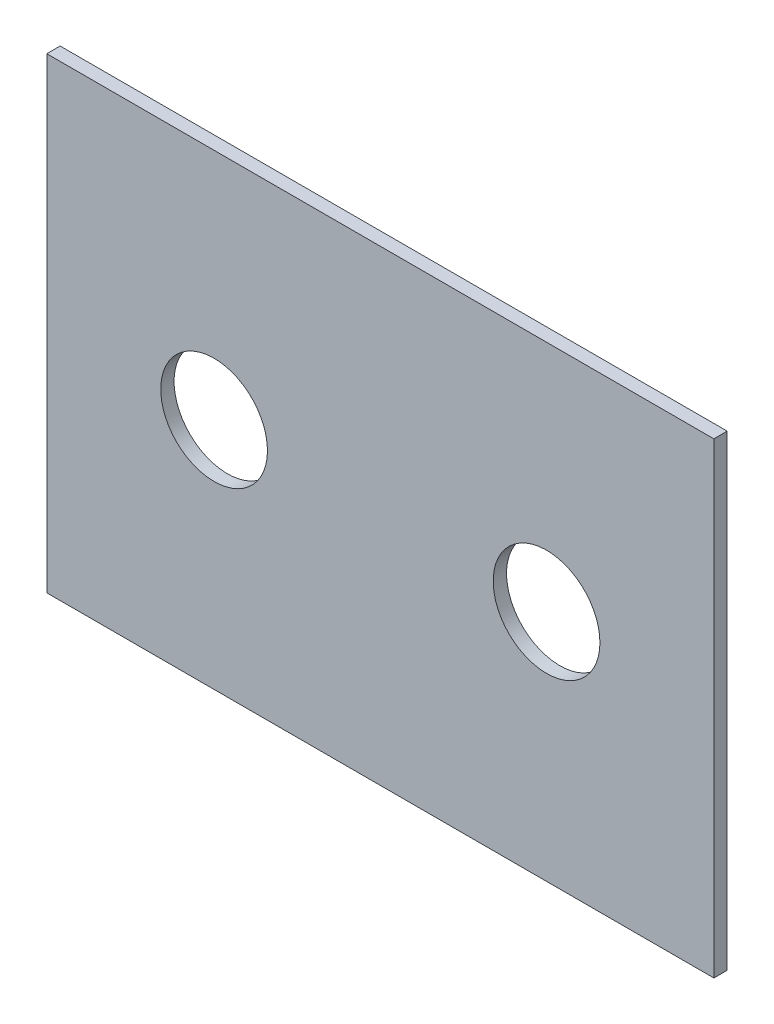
ISO-10303-21;
HEADER;
FILE_DESCRIPTION(('STEP AP214'),'2;1');
FILE_NAME('part.step','',(''),(''),'','','');
FILE_SCHEMA(('AUTOMOTIVE_DESIGN { 1 0 10303 214 1 1 1 1 }'));
ENDSEC;
DATA;
#1=APPLICATION_CONTEXT('core data for automotive mechanical design processes');
#2=APPLICATION_PROTOCOL_DEFINITION('international standard','automotive_design',2000,#1);
#3=PRODUCT_CONTEXT('',#1,'mechanical');
#4=PRODUCT('Part','Part','',(#3));
#5=PRODUCT_RELATED_PRODUCT_CATEGORY('part','',(#4));
#6=PRODUCT_DEFINITION_FORMATION('','',#4);
#7=PRODUCT_DEFINITION_CONTEXT('part definition',#1,'design');
#8=PRODUCT_DEFINITION('design','',#6,#7);
#9=PRODUCT_DEFINITION_SHAPE('','',#8);
#10=(LENGTH_UNIT() NAMED_UNIT(*) SI_UNIT(.MILLI.,.METRE.));
#11=(NAMED_UNIT(*) PLANE_ANGLE_UNIT() SI_UNIT($,.RADIAN.));
#12=(NAMED_UNIT(*) SI_UNIT($,.STERADIAN.) SOLID_ANGLE_UNIT());
#13=UNCERTAINTY_MEASURE_WITH_UNIT(LENGTH_MEASURE(1.E-05),#10,'distance_accuracy_value','');
#14=(GEOMETRIC_REPRESENTATION_CONTEXT(3) GLOBAL_UNCERTAINTY_ASSIGNED_CONTEXT((#13)) GLOBAL_UNIT_ASSIGNED_CONTEXT((#10,
#11,#12)) REPRESENTATION_CONTEXT('',''));
#15=CARTESIAN_POINT('',(0.,0.,0.));
#16=DIRECTION('',(0.,0.,1.));
#17=DIRECTION('',(1.,0.,0.));
#18=AXIS2_PLACEMENT_3D('',#15,#16,#17);
#19=CARTESIAN_POINT('',(-2.08166817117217E-13,0.,0.999999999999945));
#20=DIRECTION('',(0.,0.,-0.999999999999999));
#21=DIRECTION('',(-1.,0.,0.));
#22=AXIS2_PLACEMENT_3D('',#19,#20,#21);
#23=PLANE('',#22);
#24=DIRECTION('',(0.,0.999999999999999,0.));
#25=VECTOR('',#24,1.);
#26=CARTESIAN_POINT('',(24.9999999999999,-17.4999999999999,0.999999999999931));
#27=LINE('',#26,#25);
#28=CARTESIAN_POINT('',(24.9999999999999,-17.4999999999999,0.999999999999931));
#29=VERTEX_POINT('',#28);
#30=CARTESIAN_POINT('',(24.9999999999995,17.5,1.));
#31=VERTEX_POINT('',#30);
#32=EDGE_CURVE('E91',#29,#31,#27,.T.);
#33=ORIENTED_EDGE('',*,*,#32,.T.);
#34=DIRECTION('',(-0.999999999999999,0.,0.));
#35=VECTOR('',#34,1.);
#36=CARTESIAN_POINT('',(-25.0000000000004,17.5,0.999999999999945));
#37=LINE('',#36,#35);
#38=CARTESIAN_POINT('',(-25.0000000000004,17.5,0.999999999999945));
#39=VERTEX_POINT('',#38);
#40=EDGE_CURVE('E86',#31,#39,#37,.T.);
#41=ORIENTED_EDGE('',*,*,#40,.T.);
#42=DIRECTION('',(0.,-0.999999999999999,0.));
#43=VECTOR('',#42,1.);
#44=CARTESIAN_POINT('',(-25.0000000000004,-17.5,0.999999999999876));
#45=LINE('',#44,#43);
#46=CARTESIAN_POINT('',(-25.0000000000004,-17.5,0.999999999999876));
#47=VERTEX_POINT('',#46);
#48=EDGE_CURVE('E89',#39,#47,#45,.T.);
#49=ORIENTED_EDGE('',*,*,#48,.T.);
#50=DIRECTION('',(0.999999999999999,0.,0.));
#51=VECTOR('',#50,1.);
#52=CARTESIAN_POINT('',(-25.0000000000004,-17.5,0.999999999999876));
#53=LINE('',#52,#51);
#54=EDGE_CURVE('E56',#47,#29,#53,.T.);
#55=ORIENTED_EDGE('',*,*,#54,.T.);
#56=EDGE_LOOP('',(#33,#41,#49,#55));
#57=FACE_BOUND('',#56,.T.);
#58=CARTESIAN_POINT('',(12.4599357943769,0.,1.));
#59=DIRECTION('',(0.,0.,0.999999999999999));
#60=DIRECTION('',(1.,0.,0.));
#61=AXIS2_PLACEMENT_3D('',#58,#59,#60);
#62=CIRCLE('',#61,4.);
#63=CARTESIAN_POINT('',(16.4599357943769,0.,1.));
#64=VERTEX_POINT('',#63);
#65=EDGE_CURVE('E119',#64,#64,#62,.T.);
#66=ORIENTED_EDGE('',*,*,#65,.F.);
#67=EDGE_LOOP('',(#66));
#68=FACE_BOUND('',#67,.T.);
#69=CARTESIAN_POINT('',(-12.4599357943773,0.,0.999999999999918));
#70=DIRECTION('',(0.,0.,0.999999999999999));
#71=DIRECTION('',(1.,0.,0.));
#72=AXIS2_PLACEMENT_3D('',#69,#70,#71);
#73=CIRCLE('',#72,4.);
#74=CARTESIAN_POINT('',(-8.45993579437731,0.,0.999999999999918));
#75=VERTEX_POINT('',#74);
#76=EDGE_CURVE('E125',#75,#75,#73,.T.);
#77=ORIENTED_EDGE('',*,*,#76,.F.);
#78=EDGE_LOOP('',(#77));
#79=FACE_BOUND('',#78,.T.);
#80=ADVANCED_FACE('F39',(#57,#68,#79),#23,.F.);
#81=CARTESIAN_POINT('',(24.9999999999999,-17.4999999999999,0.999999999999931));
#82=DIRECTION('',(-1.,0.,0.));
#83=DIRECTION('',(0.,0.,0.999999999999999));
#84=AXIS2_PLACEMENT_3D('',#81,#82,#83);
#85=PLANE('',#84);
#86=DIRECTION('',(0.,0.999999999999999,0.));
#87=VECTOR('',#86,1.);
#88=CARTESIAN_POINT('',(24.9999999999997,-17.5,0.));
#89=LINE('',#88,#87);
#90=CARTESIAN_POINT('',(24.9999999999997,-17.5,0.));
#91=VERTEX_POINT('',#90);
#92=CARTESIAN_POINT('',(24.9999999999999,17.5,0.));
#93=VERTEX_POINT('',#92);
#94=EDGE_CURVE('E103',#91,#93,#89,.T.);
#95=ORIENTED_EDGE('',*,*,#94,.T.);
#96=DIRECTION('',(0.,0.,-0.999999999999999));
#97=VECTOR('',#96,1.);
#98=CARTESIAN_POINT('',(24.9999999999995,17.5,1.));
#99=LINE('',#98,#97);
#100=EDGE_CURVE('E11',#31,#93,#99,.T.);
#101=ORIENTED_EDGE('',*,*,#100,.F.);
#102=ORIENTED_EDGE('',*,*,#32,.F.);
#103=DIRECTION('',(0.,0.,-0.999999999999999));
#104=VECTOR('',#103,1.);
#105=CARTESIAN_POINT('',(24.9999999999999,-17.4999999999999,0.999999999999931));
#106=LINE('',#105,#104);
#107=EDGE_CURVE('E99',#29,#91,#106,.T.);
#108=ORIENTED_EDGE('',*,*,#107,.T.);
#109=EDGE_LOOP('',(#95,#101,#102,#108));
#110=FACE_BOUND('',#109,.T.);
#111=ADVANCED_FACE('F41',(#110),#85,.F.);
#112=CARTESIAN_POINT('',(-25.0000000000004,17.5,0.999999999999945));
#113=DIRECTION('',(0.,-0.999999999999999,0.));
#114=DIRECTION('',(0.,0.,-0.999999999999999));
#115=AXIS2_PLACEMENT_3D('',#112,#113,#114);
#116=PLANE('',#115);
#117=DIRECTION('',(-0.999999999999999,0.,0.));
#118=VECTOR('',#117,1.);
#119=CARTESIAN_POINT('',(-25.0000000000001,17.5,0.));
#120=LINE('',#119,#118);
#121=CARTESIAN_POINT('',(-25.0000000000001,17.5,0.));
#122=VERTEX_POINT('',#121);
#123=EDGE_CURVE('E95',#93,#122,#120,.T.);
#124=ORIENTED_EDGE('',*,*,#123,.T.);
#125=DIRECTION('',(0.,0.,-0.999999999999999));
#126=VECTOR('',#125,1.);
#127=CARTESIAN_POINT('',(-25.0000000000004,17.5,0.999999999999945));
#128=LINE('',#127,#126);
#129=EDGE_CURVE('E48',#39,#122,#128,.T.);
#130=ORIENTED_EDGE('',*,*,#129,.F.);
#131=ORIENTED_EDGE('',*,*,#40,.F.);
#132=ORIENTED_EDGE('',*,*,#100,.T.);
#133=EDGE_LOOP('',(#124,#130,#131,#132));
#134=FACE_BOUND('',#133,.T.);
#135=ADVANCED_FACE('F94',(#134),#116,.F.);
#136=CARTESIAN_POINT('',(-25.0000000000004,-17.5,0.999999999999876));
#137=DIRECTION('',(1.,0.,0.));
#138=DIRECTION('',(0.,0.,-0.999999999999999));
#139=AXIS2_PLACEMENT_3D('',#136,#137,#138);
#140=PLANE('',#139);
#141=DIRECTION('',(0.,-0.999999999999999,0.));
#142=VECTOR('',#141,1.);
#143=CARTESIAN_POINT('',(-25.0000000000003,-17.5,-1.11022302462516E-13));
#144=LINE('',#143,#142);
#145=CARTESIAN_POINT('',(-25.0000000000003,-17.5,-1.11022302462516E-13));
#146=VERTEX_POINT('',#145);
#147=EDGE_CURVE('E73',#122,#146,#144,.T.);
#148=ORIENTED_EDGE('',*,*,#147,.T.);
#149=DIRECTION('',(0.,0.,-0.999999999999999));
#150=VECTOR('',#149,1.);
#151=CARTESIAN_POINT('',(-25.0000000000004,-17.5,0.999999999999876));
#152=LINE('',#151,#150);
#153=EDGE_CURVE('E96',#47,#146,#152,.T.);
#154=ORIENTED_EDGE('',*,*,#153,.F.);
#155=ORIENTED_EDGE('',*,*,#48,.F.);
#156=ORIENTED_EDGE('',*,*,#129,.T.);
#157=EDGE_LOOP('',(#148,#154,#155,#156));
#158=FACE_BOUND('',#157,.T.);
#159=ADVANCED_FACE('F97',(#158),#140,.F.);
#160=CARTESIAN_POINT('',(-25.0000000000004,-17.5,0.999999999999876));
#161=DIRECTION('',(0.,0.999999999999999,0.));
#162=DIRECTION('',(0.,0.,0.999999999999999));
#163=AXIS2_PLACEMENT_3D('',#160,#161,#162);
#164=PLANE('',#163);
#165=DIRECTION('',(0.999999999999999,0.,0.));
#166=VECTOR('',#165,1.);
#167=CARTESIAN_POINT('',(-25.0000000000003,-17.5,-1.11022302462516E-13));
#168=LINE('',#167,#166);
#169=EDGE_CURVE('E79',#146,#91,#168,.T.);
#170=ORIENTED_EDGE('',*,*,#169,.T.);
#171=ORIENTED_EDGE('',*,*,#107,.F.);
#172=ORIENTED_EDGE('',*,*,#54,.F.);
#173=ORIENTED_EDGE('',*,*,#153,.T.);
#174=EDGE_LOOP('',(#170,#171,#172,#173));
#175=FACE_BOUND('',#174,.T.);
#176=ADVANCED_FACE('F111',(#175),#164,.F.);
#177=CARTESIAN_POINT('',(0.,0.,0.));
#178=DIRECTION('',(0.,0.,-0.999999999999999));
#179=DIRECTION('',(-1.,0.,0.));
#180=AXIS2_PLACEMENT_3D('',#177,#178,#179);
#181=PLANE('',#180);
#182=CARTESIAN_POINT('',(-12.4599357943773,0.,0.));
#183=DIRECTION('',(0.,0.,-0.999999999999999));
#184=DIRECTION('',(-1.,0.,0.));
#185=AXIS2_PLACEMENT_3D('',#182,#183,#184);
#186=CIRCLE('',#185,4.);
#187=CARTESIAN_POINT('',(-8.45993579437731,0.,0.));
#188=VERTEX_POINT('',#187);
#189=EDGE_CURVE('E122',#188,#188,#186,.T.);
#190=ORIENTED_EDGE('',*,*,#189,.F.);
#191=EDGE_LOOP('',(#190));
#192=FACE_BOUND('',#191,.T.);
#193=CARTESIAN_POINT('',(12.4599357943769,0.,0.));
#194=DIRECTION('',(0.,0.,-0.999999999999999));
#195=DIRECTION('',(-1.,0.,0.));
#196=AXIS2_PLACEMENT_3D('',#193,#194,#195);
#197=CIRCLE('',#196,4.);
#198=CARTESIAN_POINT('',(16.4599357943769,0.,0.));
#199=VERTEX_POINT('',#198);
#200=EDGE_CURVE('E106',#199,#199,#197,.T.);
#201=ORIENTED_EDGE('',*,*,#200,.F.);
#202=EDGE_LOOP('',(#201));
#203=FACE_BOUND('',#202,.T.);
#204=ORIENTED_EDGE('',*,*,#94,.F.);
#205=ORIENTED_EDGE('',*,*,#169,.F.);
#206=ORIENTED_EDGE('',*,*,#147,.F.);
#207=ORIENTED_EDGE('',*,*,#123,.F.);
#208=EDGE_LOOP('',(#204,#205,#206,#207));
#209=FACE_BOUND('',#208,.T.);
#210=ADVANCED_FACE('F114',(#192,#203,#209),#181,.T.);
#211=CARTESIAN_POINT('',(12.4599357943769,0.,1.));
#212=DIRECTION('',(0.,0.,0.999999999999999));
#213=DIRECTION('',(1.,0.,0.));
#214=AXIS2_PLACEMENT_3D('',#211,#212,#213);
#215=CYLINDRICAL_SURFACE('',#214,4.);
#216=CARTESIAN_POINT('',(16.4599357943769,0.,1.));
#217=CARTESIAN_POINT('',(16.4599357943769,0.,0.989583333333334));
#218=CARTESIAN_POINT('',(16.4599357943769,0.,0.979166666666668));
#219=CARTESIAN_POINT('',(16.4599357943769,0.,0.958333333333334));
#220=CARTESIAN_POINT('',(16.4599357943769,0.,0.947916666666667));
#221=CARTESIAN_POINT('',(16.4599357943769,0.,0.927083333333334));
#222=CARTESIAN_POINT('',(16.4599357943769,0.,0.916666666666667));
#223=CARTESIAN_POINT('',(16.4599357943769,0.,0.895833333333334));
#224=CARTESIAN_POINT('',(16.4599357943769,0.,0.885416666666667));
#225=CARTESIAN_POINT('',(16.4599357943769,0.,0.864583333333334));
#226=CARTESIAN_POINT('',(16.4599357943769,0.,0.854166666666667));
#227=CARTESIAN_POINT('',(16.4599357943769,0.,0.833333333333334));
#228=CARTESIAN_POINT('',(16.4599357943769,0.,0.822916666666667));
#229=CARTESIAN_POINT('',(16.4599357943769,0.,0.802083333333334));
#230=CARTESIAN_POINT('',(16.4599357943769,0.,0.791666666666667));
#231=CARTESIAN_POINT('',(16.4599357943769,0.,0.770833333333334));
#232=CARTESIAN_POINT('',(16.4599357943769,0.,0.760416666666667));
#233=CARTESIAN_POINT('',(16.4599357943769,0.,0.739583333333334));
#234=CARTESIAN_POINT('',(16.4599357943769,0.,0.729166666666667));
#235=CARTESIAN_POINT('',(16.4599357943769,0.,0.708333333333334));
#236=CARTESIAN_POINT('',(16.4599357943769,0.,0.697916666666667));
#237=CARTESIAN_POINT('',(16.4599357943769,0.,0.677083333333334));
#238=CARTESIAN_POINT('',(16.4599357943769,0.,0.666666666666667));
#239=CARTESIAN_POINT('',(16.4599357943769,0.,0.645833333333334));
#240=CARTESIAN_POINT('',(16.4599357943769,0.,0.635416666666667));
#241=CARTESIAN_POINT('',(16.4599357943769,0.,0.614583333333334));
#242=CARTESIAN_POINT('',(16.4599357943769,0.,0.604166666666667));
#243=CARTESIAN_POINT('',(16.4599357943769,0.,0.583333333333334));
#244=CARTESIAN_POINT('',(16.4599357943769,0.,0.572916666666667));
#245=CARTESIAN_POINT('',(16.4599357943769,0.,0.552083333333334));
#246=CARTESIAN_POINT('',(16.4599357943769,0.,0.541666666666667));
#247=CARTESIAN_POINT('',(16.4599357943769,0.,0.520833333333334));
#248=CARTESIAN_POINT('',(16.4599357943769,0.,0.510416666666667));
#249=CARTESIAN_POINT('',(16.4599357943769,0.,0.489583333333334));
#250=CARTESIAN_POINT('',(16.4599357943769,0.,0.479166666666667));
#251=CARTESIAN_POINT('',(16.4599357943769,0.,0.458333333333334));
#252=CARTESIAN_POINT('',(16.4599357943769,0.,0.447916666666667));
#253=CARTESIAN_POINT('',(16.4599357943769,0.,0.427083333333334));
#254=CARTESIAN_POINT('',(16.4599357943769,0.,0.416666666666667));
#255=CARTESIAN_POINT('',(16.4599357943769,0.,0.395833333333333));
#256=CARTESIAN_POINT('',(16.4599357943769,0.,0.385416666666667));
#257=CARTESIAN_POINT('',(16.4599357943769,0.,0.364583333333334));
#258=CARTESIAN_POINT('',(16.4599357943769,0.,0.354166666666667));
#259=CARTESIAN_POINT('',(16.4599357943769,0.,0.333333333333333));
#260=CARTESIAN_POINT('',(16.4599357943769,0.,0.322916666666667));
#261=CARTESIAN_POINT('',(16.4599357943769,0.,0.302083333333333));
#262=CARTESIAN_POINT('',(16.4599357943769,0.,0.291666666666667));
#263=CARTESIAN_POINT('',(16.4599357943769,0.,0.270833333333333));
#264=CARTESIAN_POINT('',(16.4599357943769,0.,0.260416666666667));
#265=CARTESIAN_POINT('',(16.4599357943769,0.,0.239583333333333));
#266=CARTESIAN_POINT('',(16.4599357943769,0.,0.229166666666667));
#267=CARTESIAN_POINT('',(16.4599357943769,0.,0.208333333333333));
#268=CARTESIAN_POINT('',(16.4599357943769,0.,0.197916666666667));
#269=CARTESIAN_POINT('',(16.4599357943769,0.,0.177083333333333));
#270=CARTESIAN_POINT('',(16.4599357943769,0.,0.166666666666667));
#271=CARTESIAN_POINT('',(16.4599357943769,0.,0.145833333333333));
#272=CARTESIAN_POINT('',(16.4599357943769,0.,0.135416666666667));
#273=CARTESIAN_POINT('',(16.4599357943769,0.,0.114583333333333));
#274=CARTESIAN_POINT('',(16.4599357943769,0.,0.104166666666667));
#275=CARTESIAN_POINT('',(16.4599357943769,0.,0.0833333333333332));
#276=CARTESIAN_POINT('',(16.4599357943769,0.,0.0729166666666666));
#277=CARTESIAN_POINT('',(16.4599357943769,0.,0.0520833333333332));
#278=CARTESIAN_POINT('',(16.4599357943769,0.,0.0416666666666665));
#279=CARTESIAN_POINT('',(16.4599357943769,0.,0.0208333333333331));
#280=CARTESIAN_POINT('',(16.4599357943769,0.,0.0104166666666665));
#281=CARTESIAN_POINT('',(16.4599357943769,0.,0.));
#282=B_SPLINE_CURVE_WITH_KNOTS('',3,(#216,#217,#218,#219,#220,#221,#222,#223,#224,#225,#226,
#227,#228,#229,#230,#231,#232,#233,#234,#235,#236,#237,#238,#239,#240,#241,#242,#243,#244,#245,
#246,#247,#248,#249,#250,#251,#252,#253,#254,#255,#256,#257,#258,#259,#260,#261,#262,#263,#264,
#265,#266,#267,#268,#269,#270,#271,#272,#273,#274,#275,#276,#277,#278,#279,#280,#281),
.UNSPECIFIED.,.F.,.F.,(4,2,2,2,2,2,2,2,2,2,2,2,2,2,2,2,2,2,2,2,2,2,2,2,2,2,2,2,2,2,2,2,4),(0.,
0.0312499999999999,0.0624999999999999,0.09375,0.125,0.15625,0.1875,0.21875,0.25,0.28125,0.3125,
0.34375,0.375,0.40625,0.4375,0.46875,0.5,0.53125,0.5625,0.593750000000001,0.625,
0.656250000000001,0.687500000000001,0.718750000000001,0.750000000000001,0.781250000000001,
0.812500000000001,0.843750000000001,0.875000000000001,0.906250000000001,0.937500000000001,
0.968750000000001,1.),.UNSPECIFIED.);
#283=EDGE_CURVE('BSEAM139',#64,#199,#282,.T.);
#284=ORIENTED_EDGE('',*,*,#65,.T.);
#285=ORIENTED_EDGE('',*,*,#200,.T.);
#286=ORIENTED_EDGE('',*,*,#283,.T.);
#287=ORIENTED_EDGE('',*,*,#283,.F.);
#288=EDGE_LOOP('',(#284,#286,#285,#287));
#289=FACE_BOUND('',#288,.T.);
#290=ADVANCED_FACE('F139',(#289),#215,.F.);
#291=CARTESIAN_POINT('',(-12.4599357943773,0.,0.999999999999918));
#292=DIRECTION('',(0.,0.,0.999999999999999));
#293=DIRECTION('',(1.,0.,0.));
#294=AXIS2_PLACEMENT_3D('',#291,#292,#293);
#295=CYLINDRICAL_SURFACE('',#294,4.);
#296=CARTESIAN_POINT('',(-8.45993579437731,0.,0.999999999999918));
#297=CARTESIAN_POINT('',(-8.45993579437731,0.,0.989583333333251));
#298=CARTESIAN_POINT('',(-8.45993579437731,0.,0.979166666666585));
#299=CARTESIAN_POINT('',(-8.45993579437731,0.,0.958333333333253));
#300=CARTESIAN_POINT('',(-8.45993579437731,0.,0.947916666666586));
#301=CARTESIAN_POINT('',(-8.45993579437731,0.,0.927083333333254));
#302=CARTESIAN_POINT('',(-8.45993579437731,0.,0.916666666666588));
#303=CARTESIAN_POINT('',(-8.45993579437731,0.,0.895833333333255));
#304=CARTESIAN_POINT('',(-8.45993579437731,0.,0.885416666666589));
#305=CARTESIAN_POINT('',(-8.45993579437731,0.,0.864583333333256));
#306=CARTESIAN_POINT('',(-8.45993579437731,0.,0.85416666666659));
#307=CARTESIAN_POINT('',(-8.45993579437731,0.,0.833333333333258));
#308=CARTESIAN_POINT('',(-8.45993579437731,0.,0.822916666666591));
#309=CARTESIAN_POINT('',(-8.45993579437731,0.,0.802083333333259));
#310=CARTESIAN_POINT('',(-8.45993579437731,0.,0.791666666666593));
#311=CARTESIAN_POINT('',(-8.45993579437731,0.,0.77083333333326));
#312=CARTESIAN_POINT('',(-8.45993579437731,0.,0.760416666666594));
#313=CARTESIAN_POINT('',(-8.45993579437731,0.,0.739583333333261));
#314=CARTESIAN_POINT('',(-8.45993579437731,0.,0.729166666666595));
#315=CARTESIAN_POINT('',(-8.45993579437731,0.,0.708333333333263));
#316=CARTESIAN_POINT('',(-8.45993579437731,0.,0.697916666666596));
#317=CARTESIAN_POINT('',(-8.45993579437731,0.,0.677083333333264));
#318=CARTESIAN_POINT('',(-8.45993579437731,0.,0.666666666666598));
#319=CARTESIAN_POINT('',(-8.45993579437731,0.,0.645833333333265));
#320=CARTESIAN_POINT('',(-8.45993579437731,0.,0.635416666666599));
#321=CARTESIAN_POINT('',(-8.45993579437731,0.,0.614583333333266));
#322=CARTESIAN_POINT('',(-8.45993579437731,0.,0.6041666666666));
#323=CARTESIAN_POINT('',(-8.45993579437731,0.,0.583333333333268));
#324=CARTESIAN_POINT('',(-8.45993579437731,0.,0.572916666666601));
#325=CARTESIAN_POINT('',(-8.45993579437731,0.,0.552083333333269));
#326=CARTESIAN_POINT('',(-8.45993579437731,0.,0.541666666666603));
#327=CARTESIAN_POINT('',(-8.45993579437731,0.,0.52083333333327));
#328=CARTESIAN_POINT('',(-8.45993579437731,0.,0.510416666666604));
#329=CARTESIAN_POINT('',(-8.45993579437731,0.,0.489583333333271));
#330=CARTESIAN_POINT('',(-8.45993579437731,0.,0.479166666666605));
#331=CARTESIAN_POINT('',(-8.45993579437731,0.,0.458333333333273));
#332=CARTESIAN_POINT('',(-8.45993579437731,0.,0.447916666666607));
#333=CARTESIAN_POINT('',(-8.45993579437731,0.,0.427083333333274));
#334=CARTESIAN_POINT('',(-8.45993579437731,0.,0.416666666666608));
#335=CARTESIAN_POINT('',(-8.45993579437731,0.,0.395833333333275));
#336=CARTESIAN_POINT('',(-8.45993579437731,0.,0.385416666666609));
#337=CARTESIAN_POINT('',(-8.45993579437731,0.,0.364583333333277));
#338=CARTESIAN_POINT('',(-8.45993579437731,0.,0.35416666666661));
#339=CARTESIAN_POINT('',(-8.45993579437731,0.,0.333333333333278));
#340=CARTESIAN_POINT('',(-8.45993579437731,0.,0.322916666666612));
#341=CARTESIAN_POINT('',(-8.45993579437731,0.,0.302083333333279));
#342=CARTESIAN_POINT('',(-8.45993579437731,0.,0.291666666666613));
#343=CARTESIAN_POINT('',(-8.45993579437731,0.,0.27083333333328));
#344=CARTESIAN_POINT('',(-8.45993579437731,0.,0.260416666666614));
#345=CARTESIAN_POINT('',(-8.45993579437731,0.,0.239583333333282));
#346=CARTESIAN_POINT('',(-8.45993579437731,0.,0.229166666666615));
#347=CARTESIAN_POINT('',(-8.45993579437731,0.,0.208333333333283));
#348=CARTESIAN_POINT('',(-8.45993579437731,0.,0.197916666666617));
#349=CARTESIAN_POINT('',(-8.45993579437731,0.,0.177083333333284));
#350=CARTESIAN_POINT('',(-8.45993579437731,0.,0.166666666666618));
#351=CARTESIAN_POINT('',(-8.45993579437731,0.,0.145833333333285));
#352=CARTESIAN_POINT('',(-8.45993579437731,0.,0.135416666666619));
#353=CARTESIAN_POINT('',(-8.45993579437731,0.,0.114583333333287));
#354=CARTESIAN_POINT('',(-8.45993579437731,0.,0.10416666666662));
#355=CARTESIAN_POINT('',(-8.45993579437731,0.,0.0833333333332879));
#356=CARTESIAN_POINT('',(-8.45993579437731,0.,0.0729166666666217));
#357=CARTESIAN_POINT('',(-8.45993579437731,0.,0.0520833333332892));
#358=CARTESIAN_POINT('',(-8.45993579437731,0.,0.0416666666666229));
#359=CARTESIAN_POINT('',(-8.45993579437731,0.,0.0208333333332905));
#360=CARTESIAN_POINT('',(-8.45993579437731,0.,0.0104166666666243));
#361=CARTESIAN_POINT('',(-8.45993579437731,0.,0.));
#362=B_SPLINE_CURVE_WITH_KNOTS('',3,(#296,#297,#298,#299,#300,#301,#302,#303,#304,#305,#306,
#307,#308,#309,#310,#311,#312,#313,#314,#315,#316,#317,#318,#319,#320,#321,#322,#323,#324,#325,
#326,#327,#328,#329,#330,#331,#332,#333,#334,#335,#336,#337,#338,#339,#340,#341,#342,#343,#344,
#345,#346,#347,#348,#349,#350,#351,#352,#353,#354,#355,#356,#357,#358,#359,#360,#361),
.UNSPECIFIED.,.F.,.F.,(4,2,2,2,2,2,2,2,2,2,2,2,2,2,2,2,2,2,2,2,2,2,2,2,2,2,2,2,2,2,2,2,4),(0.,
0.0312499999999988,0.0624999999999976,0.0937499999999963,0.124999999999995,0.156249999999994,
0.187499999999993,0.218749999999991,0.24999999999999,0.281249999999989,0.312499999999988,
0.343749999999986,0.374999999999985,0.406249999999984,0.437499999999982,0.468749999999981,
0.49999999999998,0.531249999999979,0.562499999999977,0.593749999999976,0.624999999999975,
0.656249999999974,0.687499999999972,0.718749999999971,0.74999999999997,0.781249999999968,
0.812499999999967,0.843749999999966,0.874999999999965,0.906249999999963,0.937499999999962,
0.968749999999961,0.999999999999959),.UNSPECIFIED.);
#363=EDGE_CURVE('BSEAM129',#75,#188,#362,.T.);
#364=ORIENTED_EDGE('',*,*,#76,.T.);
#365=ORIENTED_EDGE('',*,*,#189,.T.);
#366=ORIENTED_EDGE('',*,*,#363,.T.);
#367=ORIENTED_EDGE('',*,*,#363,.F.);
#368=EDGE_LOOP('',(#364,#366,#365,#367));
#369=FACE_BOUND('',#368,.T.);
#370=ADVANCED_FACE('F129',(#369),#295,.F.);
#371=CLOSED_SHELL('',(#80,#111,#135,#159,#176,#210,#290,#370));
#372=MANIFOLD_SOLID_BREP('B2',#371);
#373=ADVANCED_BREP_SHAPE_REPRESENTATION('',(#18,#372),#14);
#374=SHAPE_DEFINITION_REPRESENTATION(#9,#373);
ENDSEC;
END-ISO-10303-21;
